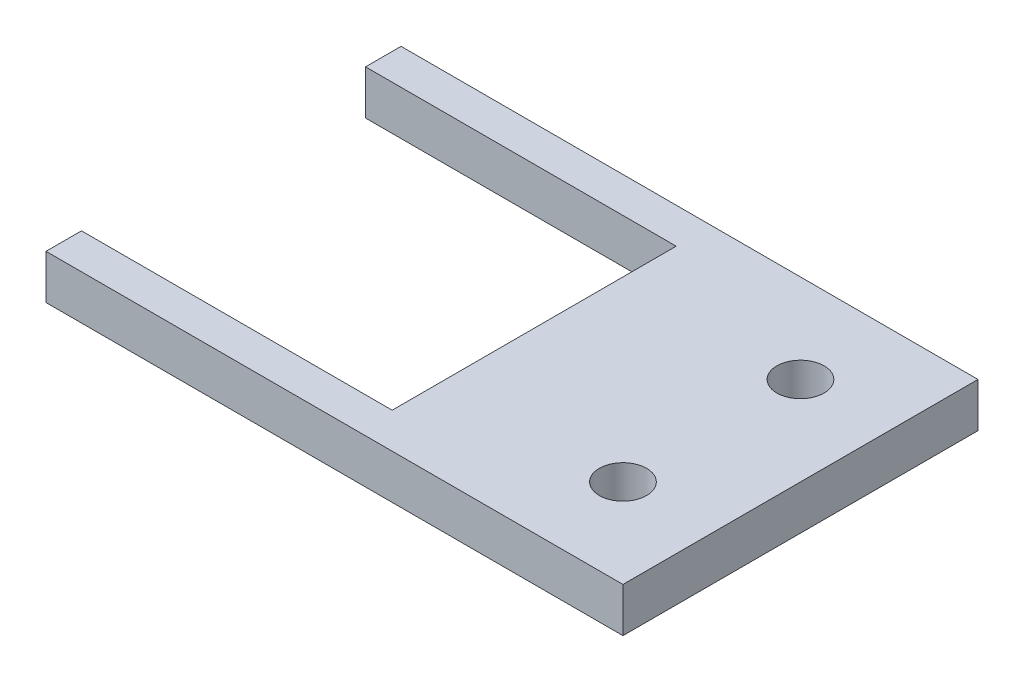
ISO-10303-21;
HEADER;
FILE_DESCRIPTION(('STEP AP214'),'2;1');
FILE_NAME('part.step','',(''),(''),'','','');
FILE_SCHEMA(('AUTOMOTIVE_DESIGN { 1 0 10303 214 1 1 1 1 }'));
ENDSEC;
DATA;
#1=APPLICATION_CONTEXT('core data for automotive mechanical design processes');
#2=APPLICATION_PROTOCOL_DEFINITION('international standard','automotive_design',2000,#1);
#3=PRODUCT_CONTEXT('',#1,'mechanical');
#4=PRODUCT('Part','Part','',(#3));
#5=PRODUCT_RELATED_PRODUCT_CATEGORY('part','',(#4));
#6=PRODUCT_DEFINITION_FORMATION('','',#4);
#7=PRODUCT_DEFINITION_CONTEXT('part definition',#1,'design');
#8=PRODUCT_DEFINITION('design','',#6,#7);
#9=PRODUCT_DEFINITION_SHAPE('','',#8);
#10=(LENGTH_UNIT() NAMED_UNIT(*) SI_UNIT(.MILLI.,.METRE.));
#11=(NAMED_UNIT(*) PLANE_ANGLE_UNIT() SI_UNIT($,.RADIAN.));
#12=(NAMED_UNIT(*) SI_UNIT($,.STERADIAN.) SOLID_ANGLE_UNIT());
#13=UNCERTAINTY_MEASURE_WITH_UNIT(LENGTH_MEASURE(1.E-05),#10,'distance_accuracy_value','');
#14=(GEOMETRIC_REPRESENTATION_CONTEXT(3) GLOBAL_UNCERTAINTY_ASSIGNED_CONTEXT((#13)) GLOBAL_UNIT_ASSIGNED_CONTEXT((#10,
#11,#12)) REPRESENTATION_CONTEXT('',''));
#15=CARTESIAN_POINT('',(0.,0.,0.));
#16=DIRECTION('',(0.,0.,1.));
#17=DIRECTION('',(1.,0.,0.));
#18=AXIS2_PLACEMENT_3D('',#15,#16,#17);
#19=CARTESIAN_POINT('',(-43.6713452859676,-6.35,-18.9612774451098));
#20=DIRECTION('',(-1.,0.,0.));
#21=DIRECTION('',(0.,0.,1.));
#22=AXIS2_PLACEMENT_3D('',#19,#20,#21);
#23=PLANE('',#22);
#24=DIRECTION('',(0.,1.,0.));
#25=VECTOR('',#24,1.);
#26=CARTESIAN_POINT('',(-43.6713452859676,-6.35,-13.8812774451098));
#27=LINE('',#26,#25);
#28=CARTESIAN_POINT('',(-43.6713452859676,-6.35,-13.8812774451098));
#29=VERTEX_POINT('',#28);
#30=CARTESIAN_POINT('',(-43.6713452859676,0.,-13.8812774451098));
#31=VERTEX_POINT('',#30);
#32=EDGE_CURVE('E80',#29,#31,#27,.T.);
#33=ORIENTED_EDGE('',*,*,#32,.T.);
#34=DIRECTION('',(0.,0.,1.));
#35=VECTOR('',#34,1.);
#36=CARTESIAN_POINT('',(-43.6713452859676,0.,-18.9612774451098));
#37=LINE('',#36,#35);
#38=CARTESIAN_POINT('',(-43.6713452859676,0.,-18.9612774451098));
#39=VERTEX_POINT('',#38);
#40=EDGE_CURVE('E102',#39,#31,#37,.T.);
#41=ORIENTED_EDGE('',*,*,#40,.F.);
#42=DIRECTION('',(0.,1.,0.));
#43=VECTOR('',#42,1.);
#44=CARTESIAN_POINT('',(-43.6713452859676,-6.35,-18.9612774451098));
#45=LINE('',#44,#43);
#46=CARTESIAN_POINT('',(-43.6713452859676,-6.35,-18.9612774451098));
#47=VERTEX_POINT('',#46);
#48=EDGE_CURVE('E11',#47,#39,#45,.T.);
#49=ORIENTED_EDGE('',*,*,#48,.F.);
#50=DIRECTION('',(0.,0.,1.));
#51=VECTOR('',#50,1.);
#52=CARTESIAN_POINT('',(-43.6713452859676,-6.35,-18.9612774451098));
#53=LINE('',#52,#51);
#54=EDGE_CURVE('E104',#47,#29,#53,.T.);
#55=ORIENTED_EDGE('',*,*,#54,.T.);
#56=EDGE_LOOP('',(#33,#41,#49,#55));
#57=FACE_BOUND('',#56,.T.);
#58=ADVANCED_FACE('F43',(#57),#23,.T.);
#59=CARTESIAN_POINT('',(0.,-6.35,0.));
#60=DIRECTION('',(0.,1.,0.));
#61=DIRECTION('',(0.,0.,1.));
#62=AXIS2_PLACEMENT_3D('',#59,#60,#61);
#63=PLANE('',#62);
#64=CARTESIAN_POINT('',(26.1786547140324,-6.35,-6.26127744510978));
#65=DIRECTION('',(0.,1.,0.));
#66=DIRECTION('',(0.,0.,1.));
#67=AXIS2_PLACEMENT_3D('',#64,#65,#66);
#68=CIRCLE('',#67,3.37819999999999);
#69=CARTESIAN_POINT('',(26.1786547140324,-6.35,-2.88307744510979));
#70=VERTEX_POINT('',#69);
#71=EDGE_CURVE('E253',#70,#70,#68,.T.);
#72=ORIENTED_EDGE('',*,*,#71,.T.);
#73=EDGE_LOOP('',(#72));
#74=FACE_BOUND('',#73,.T.);
#75=CARTESIAN_POINT('',(26.1786547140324,-6.35,19.1387225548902));
#76=DIRECTION('',(0.,1.,0.));
#77=DIRECTION('',(0.,0.,1.));
#78=AXIS2_PLACEMENT_3D('',#75,#76,#77);
#79=CIRCLE('',#78,3.37819999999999);
#80=CARTESIAN_POINT('',(26.1786547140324,-6.35,22.5169225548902));
#81=VERTEX_POINT('',#80);
#82=EDGE_CURVE('E252',#81,#81,#79,.T.);
#83=ORIENTED_EDGE('',*,*,#82,.T.);
#84=EDGE_LOOP('',(#83));
#85=FACE_BOUND('',#84,.T.);
#86=DIRECTION('',(1.,0.,0.));
#87=VECTOR('',#86,1.);
#88=CARTESIAN_POINT('',(-43.6713452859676,-6.35,26.7587225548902));
#89=LINE('',#88,#87);
#90=CARTESIAN_POINT('',(-43.6713452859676,-6.35,26.7587225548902));
#91=VERTEX_POINT('',#90);
#92=CARTESIAN_POINT('',(0.778654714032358,-6.35,26.7587225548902));
#93=VERTEX_POINT('',#92);
#94=EDGE_CURVE('E176',#91,#93,#89,.T.);
#95=ORIENTED_EDGE('',*,*,#94,.T.);
#96=DIRECTION('',(0.,0.,1.));
#97=VECTOR('',#96,1.);
#98=CARTESIAN_POINT('',(0.778654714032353,-6.35,-11.3412774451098));
#99=LINE('',#98,#97);
#100=CARTESIAN_POINT('',(0.77865471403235,-6.35,-13.8812774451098));
#101=VERTEX_POINT('',#100);
#102=EDGE_CURVE('E120',#101,#93,#99,.T.);
#103=ORIENTED_EDGE('',*,*,#102,.F.);
#104=DIRECTION('',(-1.,0.,0.));
#105=VECTOR('',#104,1.);
#106=CARTESIAN_POINT('',(-43.6713452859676,-6.35,-13.8812774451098));
#107=LINE('',#106,#105);
#108=EDGE_CURVE('E99',#101,#29,#107,.T.);
#109=ORIENTED_EDGE('',*,*,#108,.T.);
#110=ORIENTED_EDGE('',*,*,#54,.F.);
#111=DIRECTION('',(-1.,0.,0.));
#112=VECTOR('',#111,1.);
#113=CARTESIAN_POINT('',(-43.6713452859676,-6.35,-18.9612774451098));
#114=LINE('',#113,#112);
#115=CARTESIAN_POINT('',(38.8786547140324,-6.35,-18.9612774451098));
#116=VERTEX_POINT('',#115);
#117=EDGE_CURVE('E122',#116,#47,#114,.T.);
#118=ORIENTED_EDGE('',*,*,#117,.F.);
#119=DIRECTION('',(0.,0.,-1.));
#120=VECTOR('',#119,1.);
#121=CARTESIAN_POINT('',(38.8786547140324,-6.35,31.8387225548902));
#122=LINE('',#121,#120);
#123=CARTESIAN_POINT('',(38.8786547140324,-6.35,31.8387225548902));
#124=VERTEX_POINT('',#123);
#125=EDGE_CURVE('E185',#124,#116,#122,.T.);
#126=ORIENTED_EDGE('',*,*,#125,.F.);
#127=DIRECTION('',(1.,0.,0.));
#128=VECTOR('',#127,1.);
#129=CARTESIAN_POINT('',(-43.6713452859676,-6.35,31.8387225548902));
#130=LINE('',#129,#128);
#131=CARTESIAN_POINT('',(-43.6713452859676,-6.35,31.8387225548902));
#132=VERTEX_POINT('',#131);
#133=EDGE_CURVE('E138',#132,#124,#130,.T.);
#134=ORIENTED_EDGE('',*,*,#133,.F.);
#135=EDGE_CURVE('E126',#91,#132,#53,.T.);
#136=ORIENTED_EDGE('',*,*,#135,.F.);
#137=EDGE_LOOP('',(#95,#103,#109,#110,#118,#126,#134,#136));
#138=FACE_BOUND('',#137,.T.);
#139=ADVANCED_FACE('F228',(#74,#85,#138),#63,.F.);
#140=CARTESIAN_POINT('',(0.,0.,0.));
#141=DIRECTION('',(0.,1.,0.));
#142=DIRECTION('',(0.,0.,1.));
#143=AXIS2_PLACEMENT_3D('',#140,#141,#142);
#144=PLANE('',#143);
#145=CARTESIAN_POINT('',(26.1786547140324,0.,-6.26127744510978));
#146=DIRECTION('',(0.,1.,0.));
#147=DIRECTION('',(0.,0.,1.));
#148=AXIS2_PLACEMENT_3D('',#145,#146,#147);
#149=CIRCLE('',#148,3.37819999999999);
#150=CARTESIAN_POINT('',(26.1786547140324,0.,-2.88307744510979));
#151=VERTEX_POINT('',#150);
#152=EDGE_CURVE('E246',#151,#151,#149,.T.);
#153=ORIENTED_EDGE('',*,*,#152,.F.);
#154=EDGE_LOOP('',(#153));
#155=FACE_BOUND('',#154,.T.);
#156=CARTESIAN_POINT('',(26.1786547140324,0.,19.1387225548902));
#157=DIRECTION('',(0.,1.,0.));
#158=DIRECTION('',(0.,0.,1.));
#159=AXIS2_PLACEMENT_3D('',#156,#157,#158);
#160=CIRCLE('',#159,3.37819999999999);
#161=CARTESIAN_POINT('',(26.1786547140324,0.,22.5169225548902));
#162=VERTEX_POINT('',#161);
#163=EDGE_CURVE('E249',#162,#162,#160,.T.);
#164=ORIENTED_EDGE('',*,*,#163,.F.);
#165=EDGE_LOOP('',(#164));
#166=FACE_BOUND('',#165,.T.);
#167=DIRECTION('',(0.,0.,1.));
#168=VECTOR('',#167,1.);
#169=CARTESIAN_POINT('',(0.778654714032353,0.,-11.3412774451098));
#170=LINE('',#169,#168);
#171=CARTESIAN_POINT('',(0.77865471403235,0.,-13.8812774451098));
#172=VERTEX_POINT('',#171);
#173=CARTESIAN_POINT('',(0.778654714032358,0.,26.7587225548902));
#174=VERTEX_POINT('',#173);
#175=EDGE_CURVE('E106',#172,#174,#170,.T.);
#176=ORIENTED_EDGE('',*,*,#175,.T.);
#177=DIRECTION('',(1.,0.,0.));
#178=VECTOR('',#177,1.);
#179=CARTESIAN_POINT('',(0.,0.,26.7587225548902));
#180=LINE('',#179,#178);
#181=CARTESIAN_POINT('',(-43.6713452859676,0.,26.7587225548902));
#182=VERTEX_POINT('',#181);
#183=EDGE_CURVE('E100',#182,#174,#180,.T.);
#184=ORIENTED_EDGE('',*,*,#183,.F.);
#185=CARTESIAN_POINT('',(-43.6713452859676,0.,31.8387225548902));
#186=VERTEX_POINT('',#185);
#187=EDGE_CURVE('E71',#182,#186,#37,.T.);
#188=ORIENTED_EDGE('',*,*,#187,.T.);
#189=DIRECTION('',(1.,0.,0.));
#190=VECTOR('',#189,1.);
#191=CARTESIAN_POINT('',(-43.6713452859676,0.,31.8387225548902));
#192=LINE('',#191,#190);
#193=CARTESIAN_POINT('',(38.8786547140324,0.,31.8387225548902));
#194=VERTEX_POINT('',#193);
#195=EDGE_CURVE('E113',#186,#194,#192,.T.);
#196=ORIENTED_EDGE('',*,*,#195,.T.);
#197=DIRECTION('',(0.,0.,1.));
#198=VECTOR('',#197,1.);
#199=CARTESIAN_POINT('',(38.8786547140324,0.,31.8387225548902));
#200=LINE('',#199,#198);
#201=CARTESIAN_POINT('',(38.8786547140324,0.,-18.9612774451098));
#202=VERTEX_POINT('',#201);
#203=EDGE_CURVE('E167',#202,#194,#200,.T.);
#204=ORIENTED_EDGE('',*,*,#203,.F.);
#205=DIRECTION('',(-1.,0.,0.));
#206=VECTOR('',#205,1.);
#207=CARTESIAN_POINT('',(-43.6713452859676,0.,-18.9612774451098));
#208=LINE('',#207,#206);
#209=EDGE_CURVE('E111',#202,#39,#208,.T.);
#210=ORIENTED_EDGE('',*,*,#209,.T.);
#211=ORIENTED_EDGE('',*,*,#40,.T.);
#212=DIRECTION('',(-1.,0.,0.));
#213=VECTOR('',#212,1.);
#214=CARTESIAN_POINT('',(-43.6713452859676,0.,-13.8812774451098));
#215=LINE('',#214,#213);
#216=EDGE_CURVE('E92',#172,#31,#215,.T.);
#217=ORIENTED_EDGE('',*,*,#216,.F.);
#218=EDGE_LOOP('',(#176,#184,#188,#196,#204,#210,#211,#217));
#219=FACE_BOUND('',#218,.T.);
#220=ADVANCED_FACE('F108',(#155,#166,#219),#144,.T.);
#221=DIRECTION('',(0.,1.,0.));
#222=VECTOR('',#221,1.);
#223=CARTESIAN_POINT('',(-43.6713452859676,-6.35,26.7587225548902));
#224=LINE('',#223,#222);
#225=EDGE_CURVE('E183',#91,#182,#224,.T.);
#226=ORIENTED_EDGE('',*,*,#225,.F.);
#227=ORIENTED_EDGE('',*,*,#135,.T.);
#228=DIRECTION('',(0.,1.,0.));
#229=VECTOR('',#228,1.);
#230=CARTESIAN_POINT('',(-43.6713452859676,-6.35,31.8387225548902));
#231=LINE('',#230,#229);
#232=EDGE_CURVE('E47',#132,#186,#231,.T.);
#233=ORIENTED_EDGE('',*,*,#232,.T.);
#234=ORIENTED_EDGE('',*,*,#187,.F.);
#235=EDGE_LOOP('',(#226,#227,#233,#234));
#236=FACE_BOUND('',#235,.T.);
#237=ADVANCED_FACE('F45',(#236),#23,.T.);
#238=CARTESIAN_POINT('',(-43.6713452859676,-6.35,-18.9612774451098));
#239=DIRECTION('',(0.,0.,-1.));
#240=DIRECTION('',(-1.,0.,0.));
#241=AXIS2_PLACEMENT_3D('',#238,#239,#240);
#242=PLANE('',#241);
#243=ORIENTED_EDGE('',*,*,#209,.F.);
#244=DIRECTION('',(0.,1.,0.));
#245=VECTOR('',#244,1.);
#246=CARTESIAN_POINT('',(38.8786547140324,0.,-18.9612774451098));
#247=LINE('',#246,#245);
#248=EDGE_CURVE('E174',#116,#202,#247,.T.);
#249=ORIENTED_EDGE('',*,*,#248,.F.);
#250=ORIENTED_EDGE('',*,*,#117,.T.);
#251=ORIENTED_EDGE('',*,*,#48,.T.);
#252=EDGE_LOOP('',(#243,#249,#250,#251));
#253=FACE_BOUND('',#252,.T.);
#254=ADVANCED_FACE('F225',(#253),#242,.T.);
#255=CARTESIAN_POINT('',(-43.6713452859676,-6.35,31.8387225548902));
#256=DIRECTION('',(0.,0.,1.));
#257=DIRECTION('',(1.,0.,0.));
#258=AXIS2_PLACEMENT_3D('',#255,#256,#257);
#259=PLANE('',#258);
#260=ORIENTED_EDGE('',*,*,#195,.F.);
#261=ORIENTED_EDGE('',*,*,#232,.F.);
#262=ORIENTED_EDGE('',*,*,#133,.T.);
#263=DIRECTION('',(0.,-1.,0.));
#264=VECTOR('',#263,1.);
#265=CARTESIAN_POINT('',(38.8786547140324,0.,31.8387225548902));
#266=LINE('',#265,#264);
#267=EDGE_CURVE('E164',#194,#124,#266,.T.);
#268=ORIENTED_EDGE('',*,*,#267,.F.);
#269=EDGE_LOOP('',(#260,#261,#262,#268));
#270=FACE_BOUND('',#269,.T.);
#271=ADVANCED_FACE('F161',(#270),#259,.T.);
#272=CARTESIAN_POINT('',(0.778654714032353,-6.35,-11.3412774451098));
#273=DIRECTION('',(-1.,0.,0.));
#274=DIRECTION('',(0.,0.,1.));
#275=AXIS2_PLACEMENT_3D('',#272,#273,#274);
#276=PLANE('',#275);
#277=ORIENTED_EDGE('',*,*,#175,.F.);
#278=DIRECTION('',(0.,1.,0.));
#279=VECTOR('',#278,1.);
#280=CARTESIAN_POINT('',(0.77865471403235,-6.35,-13.8812774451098));
#281=LINE('',#280,#279);
#282=EDGE_CURVE('E95',#101,#172,#281,.T.);
#283=ORIENTED_EDGE('',*,*,#282,.F.);
#284=ORIENTED_EDGE('',*,*,#102,.T.);
#285=DIRECTION('',(0.,1.,0.));
#286=VECTOR('',#285,1.);
#287=CARTESIAN_POINT('',(0.778654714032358,-6.35,26.7587225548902));
#288=LINE('',#287,#286);
#289=EDGE_CURVE('E189',#93,#174,#288,.T.);
#290=ORIENTED_EDGE('',*,*,#289,.T.);
#291=EDGE_LOOP('',(#277,#283,#284,#290));
#292=FACE_BOUND('',#291,.T.);
#293=ADVANCED_FACE('F217',(#292),#276,.T.);
#294=CARTESIAN_POINT('',(-43.6713452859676,-6.35,-13.8812774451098));
#295=DIRECTION('',(0.,0.,-1.));
#296=DIRECTION('',(-1.,0.,0.));
#297=AXIS2_PLACEMENT_3D('',#294,#295,#296);
#298=PLANE('',#297);
#299=ORIENTED_EDGE('',*,*,#216,.T.);
#300=ORIENTED_EDGE('',*,*,#32,.F.);
#301=ORIENTED_EDGE('',*,*,#108,.F.);
#302=ORIENTED_EDGE('',*,*,#282,.T.);
#303=EDGE_LOOP('',(#299,#300,#301,#302));
#304=FACE_BOUND('',#303,.T.);
#305=ADVANCED_FACE('F93',(#304),#298,.F.);
#306=CARTESIAN_POINT('',(-43.6713452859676,-6.35,26.7587225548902));
#307=DIRECTION('',(0.,0.,1.));
#308=DIRECTION('',(1.,0.,0.));
#309=AXIS2_PLACEMENT_3D('',#306,#307,#308);
#310=PLANE('',#309);
#311=ORIENTED_EDGE('',*,*,#183,.T.);
#312=ORIENTED_EDGE('',*,*,#289,.F.);
#313=ORIENTED_EDGE('',*,*,#94,.F.);
#314=ORIENTED_EDGE('',*,*,#225,.T.);
#315=EDGE_LOOP('',(#311,#312,#313,#314));
#316=FACE_BOUND('',#315,.T.);
#317=ADVANCED_FACE('F215',(#316),#310,.F.);
#318=CARTESIAN_POINT('',(38.8786547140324,0.,0.));
#319=DIRECTION('',(1.,0.,0.));
#320=DIRECTION('',(0.,0.,-1.));
#321=AXIS2_PLACEMENT_3D('',#318,#319,#320);
#322=PLANE('',#321);
#323=ORIENTED_EDGE('',*,*,#267,.T.);
#324=ORIENTED_EDGE('',*,*,#125,.T.);
#325=ORIENTED_EDGE('',*,*,#248,.T.);
#326=ORIENTED_EDGE('',*,*,#203,.T.);
#327=EDGE_LOOP('',(#323,#324,#325,#326));
#328=FACE_BOUND('',#327,.T.);
#329=ADVANCED_FACE('F172',(#328),#322,.T.);
#330=CARTESIAN_POINT('',(26.1786547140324,0.,19.1387225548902));
#331=DIRECTION('',(0.,1.,0.));
#332=DIRECTION('',(0.,0.,1.));
#333=AXIS2_PLACEMENT_3D('',#330,#331,#332);
#334=CYLINDRICAL_SURFACE('',#333,3.37819999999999);
#335=ORIENTED_EDGE('',*,*,#82,.F.);
#336=EDGE_LOOP('',(#335));
#337=FACE_BOUND('',#336,.T.);
#338=ORIENTED_EDGE('',*,*,#163,.T.);
#339=EDGE_LOOP('',(#338));
#340=FACE_BOUND('',#339,.T.);
#341=ADVANCED_FACE('F290',(#337,#340),#334,.F.);
#342=CARTESIAN_POINT('',(26.1786547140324,0.,-6.26127744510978));
#343=DIRECTION('',(0.,1.,0.));
#344=DIRECTION('',(0.,0.,1.));
#345=AXIS2_PLACEMENT_3D('',#342,#343,#344);
#346=CYLINDRICAL_SURFACE('',#345,3.37819999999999);
#347=ORIENTED_EDGE('',*,*,#71,.F.);
#348=EDGE_LOOP('',(#347));
#349=FACE_BOUND('',#348,.T.);
#350=ORIENTED_EDGE('',*,*,#152,.T.);
#351=EDGE_LOOP('',(#350));
#352=FACE_BOUND('',#351,.T.);
#353=ADVANCED_FACE('F288',(#349,#352),#346,.F.);
#354=CLOSED_SHELL('',(#58,#139,#220,#237,#254,#271,#293,#305,#317,#329,#341,#353));
#355=MANIFOLD_SOLID_BREP('B2',#354);
#356=ADVANCED_BREP_SHAPE_REPRESENTATION('',(#18,#355),#14);
#357=SHAPE_DEFINITION_REPRESENTATION(#9,#356);
ENDSEC;
END-ISO-10303-21;
